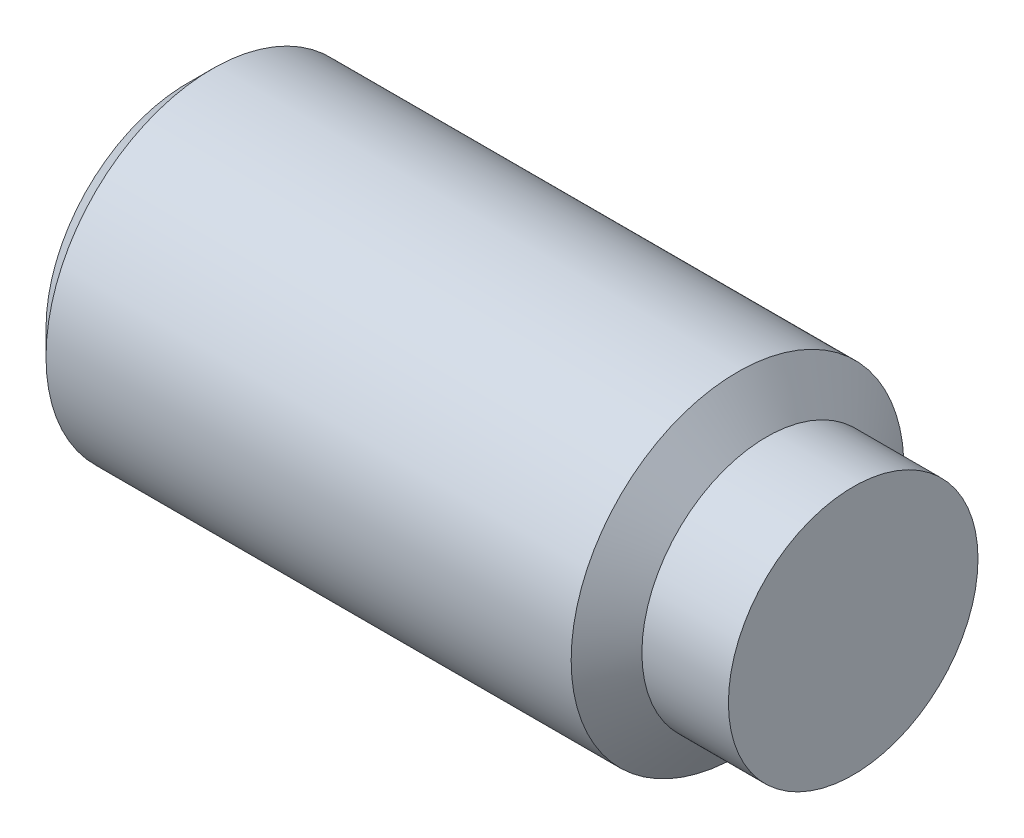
from build123d import *

# Parameters (mm, degrees)
HEX_2_DEPTH = 14.2748


with BuildPart() as part:
    # BodySke → BaseBody (revolve)
    with BuildSketch(Plane.XY, mode=Mode.PRIVATE) as basebody_sk:
        Polygon((0, 0), (0, 10.81024), (1.88976, 12.7), (41.972841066, 12.7), (44.196, 9.525), (50.8, 9.525), (50.8, 0), align=None)
    revolve(basebody_sk.sketch.rotate(Axis((-12.7, 0, 0), (1, 0, 0)), 90), axis=Axis((-12.7, 0, 0), (1, 0, 0)))

    # Sketch2 → Hex 2 (cut)
    with BuildSketch(Plane.ZY):
        Polygon((4.120779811, 7.1374), (-4.120779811, 7.1374), (-8.241559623, 0), (-4.120779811, -7.1374), (4.120779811, -7.1374), (8.241559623, 0), align=None)
    extrude(amount=-HEX_2_DEPTH, mode=Mode.SUBTRACT)


solid = part.part
